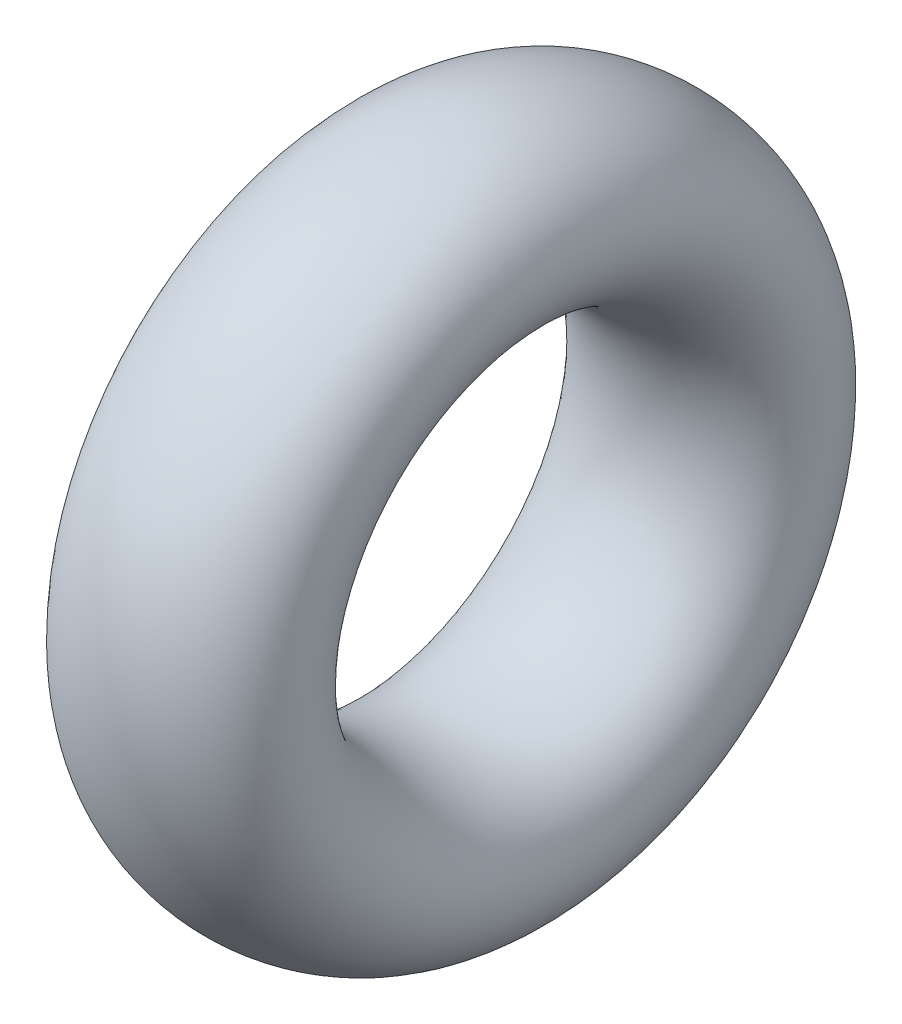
ISO-10303-21;
HEADER;
FILE_DESCRIPTION(('STEP AP214'),'2;1');
FILE_NAME('part.step','',(''),(''),'','','');
FILE_SCHEMA(('AUTOMOTIVE_DESIGN { 1 0 10303 214 1 1 1 1 }'));
ENDSEC;
DATA;
#1=APPLICATION_CONTEXT('core data for automotive mechanical design processes');
#2=APPLICATION_PROTOCOL_DEFINITION('international standard','automotive_design',2000,#1);
#3=PRODUCT_CONTEXT('',#1,'mechanical');
#4=PRODUCT('Part','Part','',(#3));
#5=PRODUCT_RELATED_PRODUCT_CATEGORY('part','',(#4));
#6=PRODUCT_DEFINITION_FORMATION('','',#4);
#7=PRODUCT_DEFINITION_CONTEXT('part definition',#1,'design');
#8=PRODUCT_DEFINITION('design','',#6,#7);
#9=PRODUCT_DEFINITION_SHAPE('','',#8);
#10=(LENGTH_UNIT() NAMED_UNIT(*) SI_UNIT(.MILLI.,.METRE.));
#11=(NAMED_UNIT(*) PLANE_ANGLE_UNIT() SI_UNIT($,.RADIAN.));
#12=(NAMED_UNIT(*) SI_UNIT($,.STERADIAN.) SOLID_ANGLE_UNIT());
#13=UNCERTAINTY_MEASURE_WITH_UNIT(LENGTH_MEASURE(1.E-05),#10,'distance_accuracy_value','');
#14=(GEOMETRIC_REPRESENTATION_CONTEXT(3) GLOBAL_UNCERTAINTY_ASSIGNED_CONTEXT((#13)) GLOBAL_UNIT_ASSIGNED_CONTEXT((#10,
#11,#12)) REPRESENTATION_CONTEXT('',''));
#15=CARTESIAN_POINT('',(0.,0.,0.));
#16=DIRECTION('',(0.,0.,1.));
#17=DIRECTION('',(1.,0.,0.));
#18=AXIS2_PLACEMENT_3D('',#15,#16,#17);
#19=CARTESIAN_POINT('',(101.,4.5,0.));
#20=DIRECTION('',(0.,0.,1.));
#21=DIRECTION('',(-1.,0.,0.));
#22=AXIS2_PLACEMENT_3D('',#19,#20,#21);
#23=ELLIPSE('',#22,2.,1.5);
#24=CARTESIAN_POINT('',(110.288869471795,0.,0.));
#25=DIRECTION('',(1.,0.,0.));
#26=AXIS1_PLACEMENT('',#24,#25);
#27=SURFACE_OF_REVOLUTION('',#23,#26);
#28=ADVANCED_FACE('F357',(),#27,.F.);
#29=CLOSED_SHELL('',(#28));
#30=MANIFOLD_SOLID_BREP('B2',#29);
#31=ADVANCED_BREP_SHAPE_REPRESENTATION('',(#18,#30),#14);
#32=SHAPE_DEFINITION_REPRESENTATION(#9,#31);
ENDSEC;
END-ISO-10303-21;
